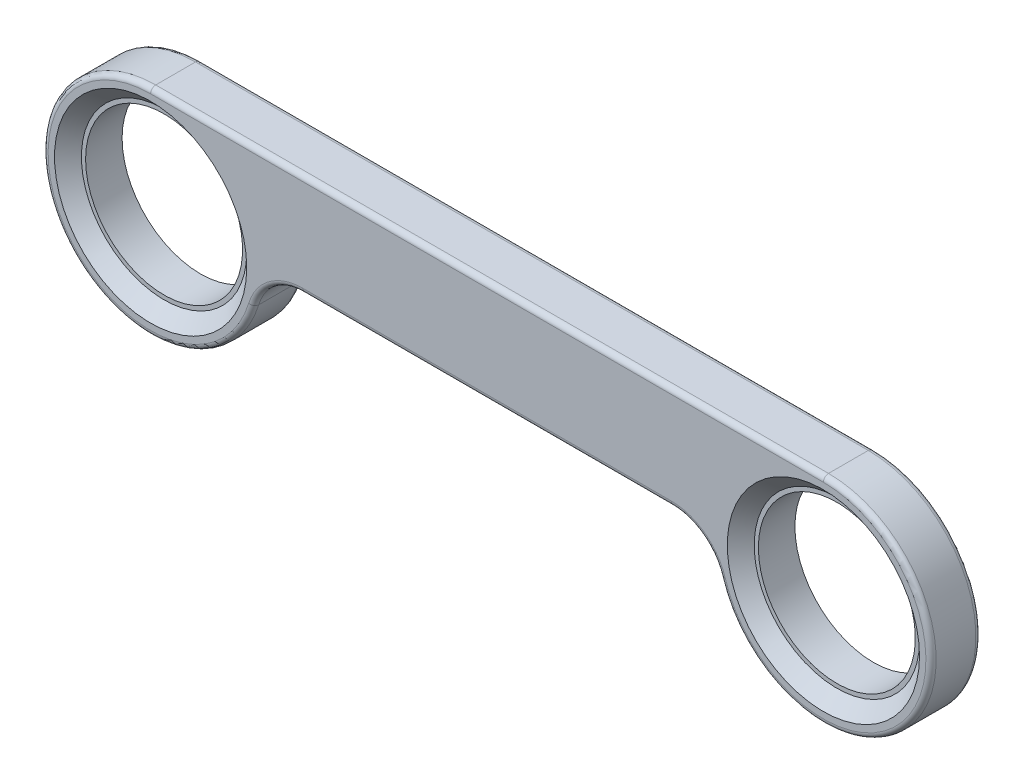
ISO-10303-21;
HEADER;
FILE_DESCRIPTION(('STEP AP214'),'2;1');
FILE_NAME('part.step','',(''),(''),'','','');
FILE_SCHEMA(('AUTOMOTIVE_DESIGN { 1 0 10303 214 1 1 1 1 }'));
ENDSEC;
DATA;
#1=APPLICATION_CONTEXT('core data for automotive mechanical design processes');
#2=APPLICATION_PROTOCOL_DEFINITION('international standard','automotive_design',2000,#1);
#3=PRODUCT_CONTEXT('',#1,'mechanical');
#4=PRODUCT('Part','Part','',(#3));
#5=PRODUCT_RELATED_PRODUCT_CATEGORY('part','',(#4));
#6=PRODUCT_DEFINITION_FORMATION('','',#4);
#7=PRODUCT_DEFINITION_CONTEXT('part definition',#1,'design');
#8=PRODUCT_DEFINITION('design','',#6,#7);
#9=PRODUCT_DEFINITION_SHAPE('','',#8);
#10=(LENGTH_UNIT() NAMED_UNIT(*) SI_UNIT(.MILLI.,.METRE.));
#11=(NAMED_UNIT(*) PLANE_ANGLE_UNIT() SI_UNIT($,.RADIAN.));
#12=(NAMED_UNIT(*) SI_UNIT($,.STERADIAN.) SOLID_ANGLE_UNIT());
#13=UNCERTAINTY_MEASURE_WITH_UNIT(LENGTH_MEASURE(1.E-05),#10,'distance_accuracy_value','');
#14=(GEOMETRIC_REPRESENTATION_CONTEXT(3) GLOBAL_UNCERTAINTY_ASSIGNED_CONTEXT((#13)) GLOBAL_UNIT_ASSIGNED_CONTEXT((#10,
#11,#12)) REPRESENTATION_CONTEXT('',''));
#15=CARTESIAN_POINT('',(0.,0.,0.));
#16=DIRECTION('',(0.,0.,1.));
#17=DIRECTION('',(1.,0.,0.));
#18=AXIS2_PLACEMENT_3D('',#15,#16,#17);
#19=CARTESIAN_POINT('',(-15.7912846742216,-4.572,2.47649999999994));
#20=DIRECTION('',(0.,0.,-1.));
#21=DIRECTION('',(-1.,0.,0.));
#22=AXIS2_PLACEMENT_3D('',#19,#20,#21);
#23=PLANE('',#22);
#24=CARTESIAN_POINT('',(-30.861,0.,2.47649999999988));
#25=DIRECTION('',(0.,0.,-1.));
#26=DIRECTION('',(-1.,0.,0.));
#27=AXIS2_PLACEMENT_3D('',#24,#25,#26);
#28=CIRCLE('',#27,10.16);
#29=CARTESIAN_POINT('',(-30.861,10.16,2.47649999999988));
#30=VERTEX_POINT('',#29);
#31=CARTESIAN_POINT('',(-21.1386030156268,-2.94967741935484,2.47649999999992));
#32=VERTEX_POINT('',#31);
#33=EDGE_CURVE('E57',#30,#32,#28,.F.);
#34=ORIENTED_EDGE('',*,*,#33,.T.);
#35=CARTESIAN_POINT('',(-15.7912846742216,-4.572,2.47649999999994));
#36=DIRECTION('',(0.,0.,-1.));
#37=DIRECTION('',(-1.,0.,0.));
#38=AXIS2_PLACEMENT_3D('',#35,#36,#37);
#39=CIRCLE('',#38,5.588);
#40=CARTESIAN_POINT('',(-15.7912846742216,1.01600000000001,2.47649999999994));
#41=VERTEX_POINT('',#40);
#42=EDGE_CURVE('E141',#32,#41,#39,.T.);
#43=ORIENTED_EDGE('',*,*,#42,.T.);
#44=DIRECTION('',(1.,0.,0.));
#45=VECTOR('',#44,1.);
#46=CARTESIAN_POINT('',(-15.7912846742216,1.01600000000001,2.47649999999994));
#47=LINE('',#46,#45);
#48=CARTESIAN_POINT('',(20.7442846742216,1.01600000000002,2.47650000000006));
#49=VERTEX_POINT('',#48);
#50=EDGE_CURVE('E167',#41,#49,#47,.T.);
#51=ORIENTED_EDGE('',*,*,#50,.T.);
#52=CARTESIAN_POINT('',(20.7442846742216,-4.57199999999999,2.47650000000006));
#53=DIRECTION('',(0.,0.,-1.));
#54=DIRECTION('',(-1.,0.,0.));
#55=AXIS2_PLACEMENT_3D('',#52,#53,#54);
#56=CIRCLE('',#55,5.588);
#57=CARTESIAN_POINT('',(26.0916030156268,-2.94967741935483,2.47650000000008));
#58=VERTEX_POINT('',#57);
#59=EDGE_CURVE('E299',#49,#58,#56,.T.);
#60=ORIENTED_EDGE('',*,*,#59,.T.);
#61=CARTESIAN_POINT('',(35.814,0.,2.47650000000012));
#62=DIRECTION('',(0.,0.,-1.));
#63=DIRECTION('',(-1.,0.,0.));
#64=AXIS2_PLACEMENT_3D('',#61,#62,#63);
#65=CIRCLE('',#64,10.16);
#66=CARTESIAN_POINT('',(35.814,10.16,2.47650000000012));
#67=VERTEX_POINT('',#66);
#68=EDGE_CURVE('E302',#58,#67,#65,.F.);
#69=ORIENTED_EDGE('',*,*,#68,.T.);
#70=DIRECTION('',(-1.,0.,0.));
#71=VECTOR('',#70,1.);
#72=CARTESIAN_POINT('',(-15.7912846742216,10.16,2.47649999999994));
#73=LINE('',#72,#71);
#74=EDGE_CURVE('E62',#67,#30,#73,.T.);
#75=ORIENTED_EDGE('',*,*,#74,.T.);
#76=EDGE_LOOP('',(#34,#43,#51,#60,#69,#75));
#77=FACE_BOUND('',#76,.T.);
#78=CARTESIAN_POINT('',(35.814,0.,2.47650000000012));
#79=DIRECTION('',(0.,0.,-1.));
#80=DIRECTION('',(-1.,0.,0.));
#81=AXIS2_PLACEMENT_3D('',#78,#79,#80);
#82=CIRCLE('',#81,9.525);
#83=CARTESIAN_POINT('',(45.339,0.,2.47650000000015));
#84=VERTEX_POINT('',#83);
#85=EDGE_CURVE('E241',#84,#84,#82,.T.);
#86=ORIENTED_EDGE('',*,*,#85,.T.);
#87=EDGE_LOOP('',(#86));
#88=FACE_BOUND('',#87,.T.);
#89=CARTESIAN_POINT('',(-30.861,0.,2.47649999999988));
#90=DIRECTION('',(0.,0.,-1.));
#91=DIRECTION('',(-1.,0.,0.));
#92=AXIS2_PLACEMENT_3D('',#89,#90,#91);
#93=CIRCLE('',#92,9.525);
#94=CARTESIAN_POINT('',(-21.336,0.,2.47649999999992));
#95=VERTEX_POINT('',#94);
#96=EDGE_CURVE('E234',#95,#95,#93,.T.);
#97=ORIENTED_EDGE('',*,*,#96,.T.);
#98=EDGE_LOOP('',(#97));
#99=FACE_BOUND('',#98,.T.);
#100=ADVANCED_FACE('F39',(#77,#88,#99),#23,.F.);
#101=CARTESIAN_POINT('',(-15.7912846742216,-4.572,-2.47650000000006));
#102=DIRECTION('',(0.,0.,-1.));
#103=DIRECTION('',(-1.,0.,0.));
#104=AXIS2_PLACEMENT_3D('',#101,#102,#103);
#105=PLANE('',#104);
#106=DIRECTION('',(1.,0.,0.));
#107=VECTOR('',#106,1.);
#108=CARTESIAN_POINT('',(-15.7912846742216,1.01600000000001,-2.47650000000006));
#109=LINE('',#108,#107);
#110=CARTESIAN_POINT('',(20.7442846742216,1.01600000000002,-2.47649999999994));
#111=VERTEX_POINT('',#110);
#112=CARTESIAN_POINT('',(-15.7912846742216,1.01600000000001,-2.47650000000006));
#113=VERTEX_POINT('',#112);
#114=EDGE_CURVE('E254',#111,#113,#109,.F.);
#115=ORIENTED_EDGE('',*,*,#114,.T.);
#116=CARTESIAN_POINT('',(-15.7912846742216,-4.572,-2.47650000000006));
#117=DIRECTION('',(0.,0.,-1.));
#118=DIRECTION('',(-1.,0.,0.));
#119=AXIS2_PLACEMENT_3D('',#116,#117,#118);
#120=CIRCLE('',#119,5.588);
#121=CARTESIAN_POINT('',(-21.1386030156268,-2.94967741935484,-2.47650000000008));
#122=VERTEX_POINT('',#121);
#123=EDGE_CURVE('E269',#113,#122,#120,.F.);
#124=ORIENTED_EDGE('',*,*,#123,.T.);
#125=CARTESIAN_POINT('',(-30.861,0.,-2.47650000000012));
#126=DIRECTION('',(0.,0.,-1.));
#127=DIRECTION('',(-1.,0.,0.));
#128=AXIS2_PLACEMENT_3D('',#125,#126,#127);
#129=CIRCLE('',#128,10.16);
#130=CARTESIAN_POINT('',(-30.861,10.16,-2.47650000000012));
#131=VERTEX_POINT('',#130);
#132=EDGE_CURVE('E266',#122,#131,#129,.T.);
#133=ORIENTED_EDGE('',*,*,#132,.T.);
#134=DIRECTION('',(-1.,0.,0.));
#135=VECTOR('',#134,1.);
#136=CARTESIAN_POINT('',(35.814,10.16,-2.47649999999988));
#137=LINE('',#136,#135);
#138=CARTESIAN_POINT('',(35.814,10.16,-2.47649999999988));
#139=VERTEX_POINT('',#138);
#140=EDGE_CURVE('E263',#131,#139,#137,.F.);
#141=ORIENTED_EDGE('',*,*,#140,.T.);
#142=CARTESIAN_POINT('',(35.814,0.,-2.47649999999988));
#143=DIRECTION('',(0.,0.,-1.));
#144=DIRECTION('',(-1.,0.,0.));
#145=AXIS2_PLACEMENT_3D('',#142,#143,#144);
#146=CIRCLE('',#145,10.16);
#147=CARTESIAN_POINT('',(26.0916030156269,-2.94967741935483,-2.47649999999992));
#148=VERTEX_POINT('',#147);
#149=EDGE_CURVE('E260',#139,#148,#146,.T.);
#150=ORIENTED_EDGE('',*,*,#149,.T.);
#151=CARTESIAN_POINT('',(20.7442846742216,-4.57199999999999,-2.47649999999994));
#152=DIRECTION('',(0.,0.,-1.));
#153=DIRECTION('',(-1.,0.,0.));
#154=AXIS2_PLACEMENT_3D('',#151,#152,#153);
#155=CIRCLE('',#154,5.588);
#156=EDGE_CURVE('E257',#148,#111,#155,.F.);
#157=ORIENTED_EDGE('',*,*,#156,.T.);
#158=EDGE_LOOP('',(#115,#124,#133,#141,#150,#157));
#159=FACE_BOUND('',#158,.T.);
#160=CARTESIAN_POINT('',(-30.861,0.,-2.47650000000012));
#161=DIRECTION('',(0.,0.,1.));
#162=DIRECTION('',(1.,0.,0.));
#163=AXIS2_PLACEMENT_3D('',#160,#161,#162);
#164=CIRCLE('',#163,7.77875);
#165=CARTESIAN_POINT('',(-23.08225,0.,-2.47650000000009));
#166=VERTEX_POINT('',#165);
#167=EDGE_CURVE('E344',#166,#166,#164,.T.);
#168=ORIENTED_EDGE('',*,*,#167,.T.);
#169=EDGE_LOOP('',(#168));
#170=FACE_BOUND('',#169,.T.);
#171=CARTESIAN_POINT('',(35.814,0.,-2.47649999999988));
#172=DIRECTION('',(0.,0.,1.));
#173=DIRECTION('',(1.,0.,0.));
#174=AXIS2_PLACEMENT_3D('',#171,#172,#173);
#175=CIRCLE('',#174,7.77875000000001);
#176=CARTESIAN_POINT('',(43.59275,0.,-2.47649999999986));
#177=VERTEX_POINT('',#176);
#178=EDGE_CURVE('E245',#177,#177,#175,.T.);
#179=ORIENTED_EDGE('',*,*,#178,.T.);
#180=EDGE_LOOP('',(#179));
#181=FACE_BOUND('',#180,.T.);
#182=ADVANCED_FACE('F355',(#159,#170,#181),#105,.T.);
#183=CARTESIAN_POINT('',(-15.7912846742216,-4.572,2.47649999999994));
#184=DIRECTION('',(0.,0.,-1.));
#185=DIRECTION('',(-1.,0.,0.));
#186=AXIS2_PLACEMENT_3D('',#183,#184,#185);
#187=CYLINDRICAL_SURFACE('',#186,5.08);
#188=DIRECTION('',(0.,0.,-1.));
#189=VECTOR('',#188,1.);
#190=CARTESIAN_POINT('',(-20.6524831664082,-3.09716129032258,2.47649999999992));
#191=LINE('',#190,#189);
#192=CARTESIAN_POINT('',(-20.6524831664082,-3.09716129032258,1.96849999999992));
#193=VERTEX_POINT('',#192);
#194=CARTESIAN_POINT('',(-20.6524831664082,-3.09716129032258,-1.96850000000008));
#195=VERTEX_POINT('',#194);
#196=EDGE_CURVE('E334',#193,#195,#191,.T.);
#197=ORIENTED_EDGE('',*,*,#196,.T.);
#198=CARTESIAN_POINT('',(-15.7912846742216,-4.572,-1.96850000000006));
#199=DIRECTION('',(0.,0.,-1.));
#200=DIRECTION('',(-1.,0.,0.));
#201=AXIS2_PLACEMENT_3D('',#198,#199,#200);
#202=CIRCLE('',#201,5.08);
#203=CARTESIAN_POINT('',(-15.7912846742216,0.50800000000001,-1.96850000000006));
#204=VERTEX_POINT('',#203);
#205=EDGE_CURVE('E152',#195,#204,#202,.T.);
#206=ORIENTED_EDGE('',*,*,#205,.T.);
#207=DIRECTION('',(0.,0.,-1.));
#208=VECTOR('',#207,1.);
#209=CARTESIAN_POINT('',(-15.7912846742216,0.50800000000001,2.47649999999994));
#210=LINE('',#209,#208);
#211=CARTESIAN_POINT('',(-15.7912846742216,0.50800000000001,1.96849999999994));
#212=VERTEX_POINT('',#211);
#213=EDGE_CURVE('E133',#212,#204,#210,.T.);
#214=ORIENTED_EDGE('',*,*,#213,.F.);
#215=CARTESIAN_POINT('',(-15.7912846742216,-4.572,1.96849999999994));
#216=DIRECTION('',(0.,0.,-1.));
#217=DIRECTION('',(-1.,0.,0.));
#218=AXIS2_PLACEMENT_3D('',#215,#216,#217);
#219=CIRCLE('',#218,5.08);
#220=EDGE_CURVE('E149',#212,#193,#219,.F.);
#221=ORIENTED_EDGE('',*,*,#220,.T.);
#222=EDGE_LOOP('',(#197,#206,#214,#221));
#223=FACE_BOUND('',#222,.T.);
#224=ADVANCED_FACE('F148',(#223),#187,.F.);
#225=CARTESIAN_POINT('',(-15.7912846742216,0.50800000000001,2.47649999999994));
#226=DIRECTION('',(0.,1.,0.));
#227=DIRECTION('',(-1.,0.,0.));
#228=AXIS2_PLACEMENT_3D('',#225,#226,#227);
#229=PLANE('',#228);
#230=ORIENTED_EDGE('',*,*,#213,.T.);
#231=DIRECTION('',(1.,0.,0.));
#232=VECTOR('',#231,1.);
#233=CARTESIAN_POINT('',(20.7442846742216,0.508000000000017,-1.96849999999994));
#234=LINE('',#233,#232);
#235=CARTESIAN_POINT('',(20.7442846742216,0.508000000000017,-1.96849999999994));
#236=VERTEX_POINT('',#235);
#237=EDGE_CURVE('E11',#204,#236,#234,.T.);
#238=ORIENTED_EDGE('',*,*,#237,.T.);
#239=DIRECTION('',(0.,0.,-1.));
#240=VECTOR('',#239,1.);
#241=CARTESIAN_POINT('',(20.7442846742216,0.508000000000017,2.47650000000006));
#242=LINE('',#241,#240);
#243=CARTESIAN_POINT('',(20.7442846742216,0.508000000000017,1.96850000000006));
#244=VERTEX_POINT('',#243);
#245=EDGE_CURVE('E135',#244,#236,#242,.T.);
#246=ORIENTED_EDGE('',*,*,#245,.F.);
#247=DIRECTION('',(1.,0.,0.));
#248=VECTOR('',#247,1.);
#249=CARTESIAN_POINT('',(-15.7912846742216,0.50800000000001,1.96849999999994));
#250=LINE('',#249,#248);
#251=EDGE_CURVE('E49',#244,#212,#250,.F.);
#252=ORIENTED_EDGE('',*,*,#251,.T.);
#253=EDGE_LOOP('',(#230,#238,#246,#252));
#254=FACE_BOUND('',#253,.T.);
#255=ADVANCED_FACE('F132',(#254),#229,.F.);
#256=CARTESIAN_POINT('',(20.7442846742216,-4.57199999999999,2.47650000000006));
#257=DIRECTION('',(0.,0.,-1.));
#258=DIRECTION('',(-1.,0.,0.));
#259=AXIS2_PLACEMENT_3D('',#256,#257,#258);
#260=CYLINDRICAL_SURFACE('',#259,5.08);
#261=ORIENTED_EDGE('',*,*,#245,.T.);
#262=CARTESIAN_POINT('',(20.7442846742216,-4.57199999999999,-1.96849999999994));
#263=DIRECTION('',(0.,0.,-1.));
#264=DIRECTION('',(-1.,0.,0.));
#265=AXIS2_PLACEMENT_3D('',#262,#263,#264);
#266=CIRCLE('',#265,5.08);
#267=CARTESIAN_POINT('',(25.6054831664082,-3.09716129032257,-1.96849999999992));
#268=VERTEX_POINT('',#267);
#269=EDGE_CURVE('E294',#236,#268,#266,.T.);
#270=ORIENTED_EDGE('',*,*,#269,.T.);
#271=DIRECTION('',(0.,0.,-1.));
#272=VECTOR('',#271,1.);
#273=CARTESIAN_POINT('',(25.6054831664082,-3.09716129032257,2.47650000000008));
#274=LINE('',#273,#272);
#275=CARTESIAN_POINT('',(25.6054831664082,-3.09716129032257,1.96850000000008));
#276=VERTEX_POINT('',#275);
#277=EDGE_CURVE('E317',#276,#268,#274,.T.);
#278=ORIENTED_EDGE('',*,*,#277,.F.);
#279=CARTESIAN_POINT('',(20.7442846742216,-4.57199999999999,1.96850000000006));
#280=DIRECTION('',(0.,0.,-1.));
#281=DIRECTION('',(-1.,0.,0.));
#282=AXIS2_PLACEMENT_3D('',#279,#280,#281);
#283=CIRCLE('',#282,5.08);
#284=EDGE_CURVE('E291',#276,#244,#283,.F.);
#285=ORIENTED_EDGE('',*,*,#284,.T.);
#286=EDGE_LOOP('',(#261,#270,#278,#285));
#287=FACE_BOUND('',#286,.T.);
#288=ADVANCED_FACE('F315',(#287),#260,.F.);
#289=CARTESIAN_POINT('',(35.814,0.,2.47650000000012));
#290=DIRECTION('',(0.,0.,-1.));
#291=DIRECTION('',(-1.,0.,0.));
#292=AXIS2_PLACEMENT_3D('',#289,#290,#291);
#293=CYLINDRICAL_SURFACE('',#292,10.668);
#294=ORIENTED_EDGE('',*,*,#277,.T.);
#295=CARTESIAN_POINT('',(35.814,0.,-1.96849999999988));
#296=DIRECTION('',(0.,0.,-1.));
#297=DIRECTION('',(-1.,0.,0.));
#298=AXIS2_PLACEMENT_3D('',#295,#296,#297);
#299=CIRCLE('',#298,10.668);
#300=CARTESIAN_POINT('',(35.814,10.668,-1.96849999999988));
#301=VERTEX_POINT('',#300);
#302=EDGE_CURVE('E288',#268,#301,#299,.F.);
#303=ORIENTED_EDGE('',*,*,#302,.T.);
#304=DIRECTION('',(0.,0.,-1.));
#305=VECTOR('',#304,1.);
#306=CARTESIAN_POINT('',(35.814,10.668,2.47650000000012));
#307=LINE('',#306,#305);
#308=CARTESIAN_POINT('',(35.814,10.668,1.96850000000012));
#309=VERTEX_POINT('',#308);
#310=EDGE_CURVE('E321',#309,#301,#307,.T.);
#311=ORIENTED_EDGE('',*,*,#310,.F.);
#312=CARTESIAN_POINT('',(35.814,0.,1.96850000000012));
#313=DIRECTION('',(0.,0.,-1.));
#314=DIRECTION('',(-1.,0.,0.));
#315=AXIS2_PLACEMENT_3D('',#312,#313,#314);
#316=CIRCLE('',#315,10.668);
#317=EDGE_CURVE('E285',#309,#276,#316,.T.);
#318=ORIENTED_EDGE('',*,*,#317,.T.);
#319=EDGE_LOOP('',(#294,#303,#311,#318));
#320=FACE_BOUND('',#319,.T.);
#321=ADVANCED_FACE('F385',(#320),#293,.T.);
#322=CARTESIAN_POINT('',(-30.861,10.668,2.47649999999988));
#323=DIRECTION('',(0.,-1.,0.));
#324=DIRECTION('',(1.,0.,0.));
#325=AXIS2_PLACEMENT_3D('',#322,#323,#324);
#326=PLANE('',#325);
#327=ORIENTED_EDGE('',*,*,#310,.T.);
#328=DIRECTION('',(-1.,0.,0.));
#329=VECTOR('',#328,1.);
#330=CARTESIAN_POINT('',(-30.861,10.668,-1.96850000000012));
#331=LINE('',#330,#329);
#332=CARTESIAN_POINT('',(-30.861,10.668,-1.96850000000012));
#333=VERTEX_POINT('',#332);
#334=EDGE_CURVE('E282',#301,#333,#331,.T.);
#335=ORIENTED_EDGE('',*,*,#334,.T.);
#336=DIRECTION('',(0.,0.,-1.));
#337=VECTOR('',#336,1.);
#338=CARTESIAN_POINT('',(-30.861,10.668,2.47649999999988));
#339=LINE('',#338,#337);
#340=CARTESIAN_POINT('',(-30.861,10.668,1.96849999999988));
#341=VERTEX_POINT('',#340);
#342=EDGE_CURVE('E332',#341,#333,#339,.T.);
#343=ORIENTED_EDGE('',*,*,#342,.F.);
#344=DIRECTION('',(-1.,0.,0.));
#345=VECTOR('',#344,1.);
#346=CARTESIAN_POINT('',(-30.861,10.668,1.96849999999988));
#347=LINE('',#346,#345);
#348=EDGE_CURVE('E279',#341,#309,#347,.F.);
#349=ORIENTED_EDGE('',*,*,#348,.T.);
#350=EDGE_LOOP('',(#327,#335,#343,#349));
#351=FACE_BOUND('',#350,.T.);
#352=ADVANCED_FACE('F337',(#351),#326,.F.);
#353=CARTESIAN_POINT('',(-30.861,0.,2.47649999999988));
#354=DIRECTION('',(0.,0.,-1.));
#355=DIRECTION('',(-1.,0.,0.));
#356=AXIS2_PLACEMENT_3D('',#353,#354,#355);
#357=CYLINDRICAL_SURFACE('',#356,10.668);
#358=ORIENTED_EDGE('',*,*,#342,.T.);
#359=CARTESIAN_POINT('',(-30.861,0.,-1.96850000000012));
#360=DIRECTION('',(0.,0.,-1.));
#361=DIRECTION('',(-1.,0.,0.));
#362=AXIS2_PLACEMENT_3D('',#359,#360,#361);
#363=CIRCLE('',#362,10.668);
#364=EDGE_CURVE('E276',#333,#195,#363,.F.);
#365=ORIENTED_EDGE('',*,*,#364,.T.);
#366=ORIENTED_EDGE('',*,*,#196,.F.);
#367=CARTESIAN_POINT('',(-30.861,0.,1.96849999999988));
#368=DIRECTION('',(0.,0.,-1.));
#369=DIRECTION('',(-1.,0.,0.));
#370=AXIS2_PLACEMENT_3D('',#367,#368,#369);
#371=CIRCLE('',#370,10.668);
#372=EDGE_CURVE('E273',#193,#341,#371,.T.);
#373=ORIENTED_EDGE('',*,*,#372,.T.);
#374=EDGE_LOOP('',(#358,#365,#366,#373));
#375=FACE_BOUND('',#374,.T.);
#376=ADVANCED_FACE('F331',(#375),#357,.T.);
#377=CARTESIAN_POINT('',(-30.861,0.,2.47649999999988));
#378=DIRECTION('',(0.,0.,-1.));
#379=DIRECTION('',(-1.,0.,0.));
#380=AXIS2_PLACEMENT_3D('',#377,#378,#379);
#381=CYLINDRICAL_SURFACE('',#380,7.77875);
#382=CARTESIAN_POINT('',(-30.861,0.,1.14299999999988));
#383=DIRECTION('',(0.,0.,-1.));
#384=DIRECTION('',(-1.,0.,0.));
#385=AXIS2_PLACEMENT_3D('',#382,#383,#384);
#386=CIRCLE('',#385,7.77875);
#387=CARTESIAN_POINT('',(-38.63975,0.,1.14299999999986));
#388=VERTEX_POINT('',#387);
#389=EDGE_CURVE('E228',#388,#388,#386,.T.);
#390=ORIENTED_EDGE('',*,*,#389,.F.);
#391=EDGE_LOOP('',(#390));
#392=FACE_BOUND('',#391,.T.);
#393=ORIENTED_EDGE('',*,*,#167,.F.);
#394=EDGE_LOOP('',(#393));
#395=FACE_BOUND('',#394,.T.);
#396=ADVANCED_FACE('F360',(#392,#395),#381,.F.);
#397=CARTESIAN_POINT('',(35.814,0.,2.47650000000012));
#398=DIRECTION('',(0.,0.,-1.));
#399=DIRECTION('',(-1.,0.,0.));
#400=AXIS2_PLACEMENT_3D('',#397,#398,#399);
#401=CYLINDRICAL_SURFACE('',#400,7.77875000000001);
#402=CARTESIAN_POINT('',(35.814,0.,1.14300000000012));
#403=DIRECTION('',(0.,0.,-1.));
#404=DIRECTION('',(-1.,0.,0.));
#405=AXIS2_PLACEMENT_3D('',#402,#403,#404);
#406=CIRCLE('',#405,7.77875000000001);
#407=CARTESIAN_POINT('',(28.03525,0.,1.14300000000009));
#408=VERTEX_POINT('',#407);
#409=EDGE_CURVE('E221',#408,#408,#406,.T.);
#410=ORIENTED_EDGE('',*,*,#409,.F.);
#411=EDGE_LOOP('',(#410));
#412=FACE_BOUND('',#411,.T.);
#413=ORIENTED_EDGE('',*,*,#178,.F.);
#414=EDGE_LOOP('',(#413));
#415=FACE_BOUND('',#414,.T.);
#416=ADVANCED_FACE('F357',(#412,#415),#401,.F.);
#417=CARTESIAN_POINT('',(35.814,0.,1.14300000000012));
#418=DIRECTION('',(0.,0.,-1.));
#419=DIRECTION('',(-1.,0.,0.));
#420=AXIS2_PLACEMENT_3D('',#417,#418,#419);
#421=PLANE('',#420);
#422=CARTESIAN_POINT('',(35.814,0.,1.14300000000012));
#423=DIRECTION('',(0.,0.,-1.));
#424=DIRECTION('',(-1.,0.,0.));
#425=AXIS2_PLACEMENT_3D('',#422,#423,#424);
#426=CIRCLE('',#425,8.19150000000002);
#427=CARTESIAN_POINT('',(44.0055,0.,1.14300000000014));
#428=VERTEX_POINT('',#427);
#429=EDGE_CURVE('E154',#428,#428,#426,.F.);
#430=ORIENTED_EDGE('',*,*,#429,.T.);
#431=EDGE_LOOP('',(#430));
#432=FACE_BOUND('',#431,.T.);
#433=ORIENTED_EDGE('',*,*,#409,.T.);
#434=EDGE_LOOP('',(#433));
#435=FACE_BOUND('',#434,.T.);
#436=ADVANCED_FACE('F359',(#432,#435),#421,.F.);
#437=CARTESIAN_POINT('',(-30.861,0.,1.14299999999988));
#438=DIRECTION('',(0.,0.,-1.));
#439=DIRECTION('',(-1.,0.,0.));
#440=AXIS2_PLACEMENT_3D('',#437,#438,#439);
#441=PLANE('',#440);
#442=CARTESIAN_POINT('',(-30.861,0.,1.14299999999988));
#443=DIRECTION('',(0.,0.,-1.));
#444=DIRECTION('',(-1.,0.,0.));
#445=AXIS2_PLACEMENT_3D('',#442,#443,#444);
#446=CIRCLE('',#445,8.19150000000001);
#447=CARTESIAN_POINT('',(-22.6695,0.,1.14299999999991));
#448=VERTEX_POINT('',#447);
#449=EDGE_CURVE('E164',#448,#448,#446,.F.);
#450=ORIENTED_EDGE('',*,*,#449,.T.);
#451=EDGE_LOOP('',(#450));
#452=FACE_BOUND('',#451,.T.);
#453=ORIENTED_EDGE('',*,*,#389,.T.);
#454=EDGE_LOOP('',(#453));
#455=FACE_BOUND('',#454,.T.);
#456=ADVANCED_FACE('F367',(#452,#455),#441,.F.);
#457=CARTESIAN_POINT('',(35.814,0.,2.47650000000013));
#458=DIRECTION('',(0.,0.,1.));
#459=DIRECTION('',(1.,0.,0.));
#460=AXIS2_PLACEMENT_3D('',#457,#458,#459);
#461=CONICAL_SURFACE('',#460,9.525,0.785398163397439);
#462=CARTESIAN_POINT('',(44.0055,0.,1.14300000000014));
#463=CARTESIAN_POINT('',(44.019390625,0.,1.15689062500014));
#464=CARTESIAN_POINT('',(44.03328125,0.,1.17078125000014));
#465=CARTESIAN_POINT('',(44.0610625,0.,1.19856250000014));
#466=CARTESIAN_POINT('',(44.074953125,0.,1.21245312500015));
#467=CARTESIAN_POINT('',(44.102734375,0.,1.24023437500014));
#468=CARTESIAN_POINT('',(44.116625,0.,1.25412500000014));
#469=CARTESIAN_POINT('',(44.14440625,0.,1.28190625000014));
#470=CARTESIAN_POINT('',(44.158296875,0.,1.29579687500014));
#471=CARTESIAN_POINT('',(44.186078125,0.,1.32357812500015));
#472=CARTESIAN_POINT('',(44.19996875,0.,1.33746875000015));
#473=CARTESIAN_POINT('',(44.22775,0.,1.36525000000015));
#474=CARTESIAN_POINT('',(44.241640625,0.,1.37914062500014));
#475=CARTESIAN_POINT('',(44.269421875,0.,1.40692187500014));
#476=CARTESIAN_POINT('',(44.2833125,0.,1.42081250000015));
#477=CARTESIAN_POINT('',(44.31109375,0.,1.44859375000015));
#478=CARTESIAN_POINT('',(44.324984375,0.,1.46248437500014));
#479=CARTESIAN_POINT('',(44.352765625,0.,1.49026562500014));
#480=CARTESIAN_POINT('',(44.36665625,0.,1.50415625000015));
#481=CARTESIAN_POINT('',(44.3944375,0.,1.53193750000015));
#482=CARTESIAN_POINT('',(44.408328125,0.,1.54582812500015));
#483=CARTESIAN_POINT('',(44.436109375,0.,1.57360937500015));
#484=CARTESIAN_POINT('',(44.45,0.,1.58750000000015));
#485=CARTESIAN_POINT('',(44.47778125,0.,1.61528125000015));
#486=CARTESIAN_POINT('',(44.491671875,0.,1.62917187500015));
#487=CARTESIAN_POINT('',(44.519453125,0.,1.65695312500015));
#488=CARTESIAN_POINT('',(44.53334375,0.,1.67084375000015));
#489=CARTESIAN_POINT('',(44.561125,0.,1.69862500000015));
#490=CARTESIAN_POINT('',(44.575015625,0.,1.71251562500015));
#491=CARTESIAN_POINT('',(44.602796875,0.,1.74029687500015));
#492=CARTESIAN_POINT('',(44.6166875,0.,1.75418750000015));
#493=CARTESIAN_POINT('',(44.64446875,0.,1.78196875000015));
#494=CARTESIAN_POINT('',(44.658359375,0.,1.79585937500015));
#495=CARTESIAN_POINT('',(44.686140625,0.,1.82364062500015));
#496=CARTESIAN_POINT('',(44.70003125,0.,1.83753125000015));
#497=CARTESIAN_POINT('',(44.7278125,0.,1.86531250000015));
#498=CARTESIAN_POINT('',(44.741703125,0.,1.87920312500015));
#499=CARTESIAN_POINT('',(44.769484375,0.,1.90698437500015));
#500=CARTESIAN_POINT('',(44.783375,0.,1.92087500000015));
#501=CARTESIAN_POINT('',(44.81115625,0.,1.94865625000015));
#502=CARTESIAN_POINT('',(44.825046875,0.,1.96254687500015));
#503=CARTESIAN_POINT('',(44.852828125,0.,1.99032812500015));
#504=CARTESIAN_POINT('',(44.86671875,0.,2.00421875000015));
#505=CARTESIAN_POINT('',(44.8945,0.,2.03200000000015));
#506=CARTESIAN_POINT('',(44.908390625,0.,2.04589062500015));
#507=CARTESIAN_POINT('',(44.936171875,0.,2.07367187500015));
#508=CARTESIAN_POINT('',(44.9500625,0.,2.08756250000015));
#509=CARTESIAN_POINT('',(44.97784375,0.,2.11534375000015));
#510=CARTESIAN_POINT('',(44.991734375,0.,2.12923437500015));
#511=CARTESIAN_POINT('',(45.019515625,0.,2.15701562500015));
#512=CARTESIAN_POINT('',(45.03340625,0.,2.17090625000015));
#513=CARTESIAN_POINT('',(45.0611875,0.,2.19868750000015));
#514=CARTESIAN_POINT('',(45.075078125,0.,2.21257812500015));
#515=CARTESIAN_POINT('',(45.102859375,0.,2.24035937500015));
#516=CARTESIAN_POINT('',(45.11675,0.,2.25425000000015));
#517=CARTESIAN_POINT('',(45.14453125,0.,2.28203125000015));
#518=CARTESIAN_POINT('',(45.158421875,0.,2.29592187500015));
#519=CARTESIAN_POINT('',(45.186203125,0.,2.32370312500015));
#520=CARTESIAN_POINT('',(45.20009375,0.,2.33759375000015));
#521=CARTESIAN_POINT('',(45.227875,0.,2.36537500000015));
#522=CARTESIAN_POINT('',(45.241765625,0.,2.37926562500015));
#523=CARTESIAN_POINT('',(45.269546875,0.,2.40704687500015));
#524=CARTESIAN_POINT('',(45.2834375,0.,2.42093750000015));
#525=CARTESIAN_POINT('',(45.31121875,0.,2.44871875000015));
#526=CARTESIAN_POINT('',(45.325109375,0.,2.46260937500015));
#527=CARTESIAN_POINT('',(45.339,0.,2.47650000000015));
#528=B_SPLINE_CURVE_WITH_KNOTS('',3,(#462,#463,#464,#465,#466,#467,#468,#469,#470,#471,#472,
#473,#474,#475,#476,#477,#478,#479,#480,#481,#482,#483,#484,#485,#486,#487,#488,#489,#490,#491,
#492,#493,#494,#495,#496,#497,#498,#499,#500,#501,#502,#503,#504,#505,#506,#507,#508,#509,#510,
#511,#512,#513,#514,#515,#516,#517,#518,#519,#520,#521,#522,#523,#524,#525,#526,#527),
.UNSPECIFIED.,.F.,.F.,(4,2,2,2,2,2,2,2,2,2,2,2,2,2,2,2,2,2,2,2,2,2,2,2,2,2,2,2,2,2,2,2,4),(0.,
0.0589329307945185,0.117865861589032,0.176798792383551,0.235731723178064,0.294664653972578,
0.353597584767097,0.41253051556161,0.471463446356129,0.530396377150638,0.589329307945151,
0.64826223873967,0.707195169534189,0.766128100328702,0.825061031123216,0.883993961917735,
0.942926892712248,1.00185982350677,1.06079275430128,1.11972568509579,1.17865861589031,
1.23759154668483,1.29652447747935,1.35545740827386,1.41439033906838,1.47332326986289,
1.53225620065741,1.59118913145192,1.65012206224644,1.70905499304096,1.76798792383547,
1.82692085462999,1.8858537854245),.UNSPECIFIED.);
#529=EDGE_CURVE('BSEAM394',#428,#84,#528,.T.);
#530=ORIENTED_EDGE('',*,*,#429,.F.);
#531=ORIENTED_EDGE('',*,*,#85,.F.);
#532=ORIENTED_EDGE('',*,*,#529,.T.);
#533=ORIENTED_EDGE('',*,*,#529,.F.);
#534=EDGE_LOOP('',(#530,#532,#531,#533));
#535=FACE_BOUND('',#534,.T.);
#536=ADVANCED_FACE('F394',(#535),#461,.F.);
#537=CARTESIAN_POINT('',(-30.861,0.,2.4764999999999));
#538=DIRECTION('',(0.,0.,1.));
#539=DIRECTION('',(1.,0.,0.));
#540=AXIS2_PLACEMENT_3D('',#537,#538,#539);
#541=CONICAL_SURFACE('',#540,9.525,0.785398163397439);
#542=CARTESIAN_POINT('',(-22.6695,0.,1.14299999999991));
#543=CARTESIAN_POINT('',(-22.655609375,0.,1.15689062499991));
#544=CARTESIAN_POINT('',(-22.64171875,0.,1.17078124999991));
#545=CARTESIAN_POINT('',(-22.6139375,0.,1.19856249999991));
#546=CARTESIAN_POINT('',(-22.600046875,0.,1.21245312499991));
#547=CARTESIAN_POINT('',(-22.572265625,0.,1.24023437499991));
#548=CARTESIAN_POINT('',(-22.558375,0.,1.25412499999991));
#549=CARTESIAN_POINT('',(-22.53059375,0.,1.28190624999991));
#550=CARTESIAN_POINT('',(-22.516703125,0.,1.29579687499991));
#551=CARTESIAN_POINT('',(-22.488921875,0.,1.32357812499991));
#552=CARTESIAN_POINT('',(-22.47503125,0.,1.33746874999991));
#553=CARTESIAN_POINT('',(-22.44725,0.,1.36524999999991));
#554=CARTESIAN_POINT('',(-22.433359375,0.,1.37914062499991));
#555=CARTESIAN_POINT('',(-22.405578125,0.,1.40692187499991));
#556=CARTESIAN_POINT('',(-22.3916875,0.,1.42081249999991));
#557=CARTESIAN_POINT('',(-22.36390625,0.,1.44859374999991));
#558=CARTESIAN_POINT('',(-22.350015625,0.,1.46248437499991));
#559=CARTESIAN_POINT('',(-22.322234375,0.,1.49026562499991));
#560=CARTESIAN_POINT('',(-22.30834375,0.,1.50415624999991));
#561=CARTESIAN_POINT('',(-22.2805625,0.,1.53193749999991));
#562=CARTESIAN_POINT('',(-22.266671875,0.,1.54582812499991));
#563=CARTESIAN_POINT('',(-22.238890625,0.,1.57360937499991));
#564=CARTESIAN_POINT('',(-22.225,0.,1.58749999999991));
#565=CARTESIAN_POINT('',(-22.19721875,0.,1.61528124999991));
#566=CARTESIAN_POINT('',(-22.183328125,0.,1.62917187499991));
#567=CARTESIAN_POINT('',(-22.155546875,0.,1.65695312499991));
#568=CARTESIAN_POINT('',(-22.14165625,0.,1.67084374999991));
#569=CARTESIAN_POINT('',(-22.113875,0.,1.69862499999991));
#570=CARTESIAN_POINT('',(-22.099984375,0.,1.71251562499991));
#571=CARTESIAN_POINT('',(-22.072203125,0.,1.74029687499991));
#572=CARTESIAN_POINT('',(-22.0583125,0.,1.75418749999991));
#573=CARTESIAN_POINT('',(-22.03053125,0.,1.78196874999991));
#574=CARTESIAN_POINT('',(-22.016640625,0.,1.79585937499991));
#575=CARTESIAN_POINT('',(-21.988859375,0.,1.82364062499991));
#576=CARTESIAN_POINT('',(-21.97496875,0.,1.83753124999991));
#577=CARTESIAN_POINT('',(-21.9471875,0.,1.86531249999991));
#578=CARTESIAN_POINT('',(-21.933296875,0.,1.87920312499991));
#579=CARTESIAN_POINT('',(-21.905515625,0.,1.90698437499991));
#580=CARTESIAN_POINT('',(-21.891625,0.,1.92087499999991));
#581=CARTESIAN_POINT('',(-21.86384375,0.,1.94865624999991));
#582=CARTESIAN_POINT('',(-21.849953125,0.,1.96254687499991));
#583=CARTESIAN_POINT('',(-21.822171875,0.,1.99032812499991));
#584=CARTESIAN_POINT('',(-21.80828125,0.,2.00421874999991));
#585=CARTESIAN_POINT('',(-21.7805,0.,2.03199999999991));
#586=CARTESIAN_POINT('',(-21.766609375,0.,2.04589062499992));
#587=CARTESIAN_POINT('',(-21.738828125,0.,2.07367187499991));
#588=CARTESIAN_POINT('',(-21.7249375,0.,2.08756249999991));
#589=CARTESIAN_POINT('',(-21.69715625,0.,2.11534374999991));
#590=CARTESIAN_POINT('',(-21.683265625,0.,2.12923437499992));
#591=CARTESIAN_POINT('',(-21.655484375,0.,2.15701562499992));
#592=CARTESIAN_POINT('',(-21.64159375,0.,2.17090624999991));
#593=CARTESIAN_POINT('',(-21.6138125,0.,2.19868749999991));
#594=CARTESIAN_POINT('',(-21.599921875,0.,2.21257812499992));
#595=CARTESIAN_POINT('',(-21.572140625,0.,2.24035937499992));
#596=CARTESIAN_POINT('',(-21.55825,0.,2.25424999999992));
#597=CARTESIAN_POINT('',(-21.53046875,0.,2.28203124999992));
#598=CARTESIAN_POINT('',(-21.516578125,0.,2.29592187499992));
#599=CARTESIAN_POINT('',(-21.488796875,0.,2.32370312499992));
#600=CARTESIAN_POINT('',(-21.47490625,0.,2.33759374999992));
#601=CARTESIAN_POINT('',(-21.447125,0.,2.36537499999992));
#602=CARTESIAN_POINT('',(-21.433234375,0.,2.37926562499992));
#603=CARTESIAN_POINT('',(-21.405453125,0.,2.40704687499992));
#604=CARTESIAN_POINT('',(-21.3915625,0.,2.42093749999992));
#605=CARTESIAN_POINT('',(-21.36378125,0.,2.44871874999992));
#606=CARTESIAN_POINT('',(-21.349890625,0.,2.46260937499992));
#607=CARTESIAN_POINT('',(-21.336,0.,2.47649999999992));
#608=B_SPLINE_CURVE_WITH_KNOTS('',3,(#542,#543,#544,#545,#546,#547,#548,#549,#550,#551,#552,
#553,#554,#555,#556,#557,#558,#559,#560,#561,#562,#563,#564,#565,#566,#567,#568,#569,#570,#571,
#572,#573,#574,#575,#576,#577,#578,#579,#580,#581,#582,#583,#584,#585,#586,#587,#588,#589,#590,
#591,#592,#593,#594,#595,#596,#597,#598,#599,#600,#601,#602,#603,#604,#605,#606,#607),
.UNSPECIFIED.,.F.,.F.,(4,2,2,2,2,2,2,2,2,2,2,2,2,2,2,2,2,2,2,2,2,2,2,2,2,2,2,2,2,2,2,2,4),(0.,
0.0589329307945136,0.11786586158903,0.176798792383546,0.235731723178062,0.294664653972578,
0.353597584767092,0.41253051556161,0.471463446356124,0.530396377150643,0.589329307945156,
0.648262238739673,0.707195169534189,0.766128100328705,0.825061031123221,0.883993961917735,
0.942926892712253,1.00185982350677,1.06079275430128,1.1197256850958,1.17865861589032,
1.23759154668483,1.29652447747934,1.35545740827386,1.41439033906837,1.47332326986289,
1.53225620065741,1.59118913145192,1.65012206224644,1.70905499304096,1.76798792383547,
1.82692085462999,1.8858537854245),.UNSPECIFIED.);
#609=EDGE_CURVE('BSEAM397',#448,#95,#608,.T.);
#610=ORIENTED_EDGE('',*,*,#449,.F.);
#611=ORIENTED_EDGE('',*,*,#96,.F.);
#612=ORIENTED_EDGE('',*,*,#609,.T.);
#613=ORIENTED_EDGE('',*,*,#609,.F.);
#614=EDGE_LOOP('',(#610,#612,#611,#613));
#615=FACE_BOUND('',#614,.T.);
#616=ADVANCED_FACE('F397',(#615),#541,.F.);
#617=CARTESIAN_POINT('',(35.814,0.,-1.96849999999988));
#618=DIRECTION('',(0.,0.,-1.));
#619=DIRECTION('',(-1.,0.,0.));
#620=AXIS2_PLACEMENT_3D('',#617,#618,#619);
#621=TOROIDAL_SURFACE('',#620,10.16,0.508);
#622=CARTESIAN_POINT('',(26.0916030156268,-2.94967741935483,-1.96849999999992));
#623=DIRECTION('',(-0.290322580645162,0.956928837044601,0.));
#624=DIRECTION('',(-0.956928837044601,-0.290322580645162,0.));
#625=AXIS2_PLACEMENT_3D('',#622,#623,#624);
#626=CIRCLE('',#625,0.508);
#627=EDGE_CURVE('E212',#148,#268,#626,.T.);
#628=ORIENTED_EDGE('',*,*,#627,.F.);
#629=ORIENTED_EDGE('',*,*,#149,.F.);
#630=CARTESIAN_POINT('',(35.814,10.16,-1.96849999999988));
#631=DIRECTION('',(-1.,0.,0.));
#632=DIRECTION('',(0.,0.,1.));
#633=AXIS2_PLACEMENT_3D('',#630,#631,#632);
#634=CIRCLE('',#633,0.508);
#635=EDGE_CURVE('E174',#301,#139,#634,.T.);
#636=ORIENTED_EDGE('',*,*,#635,.F.);
#637=ORIENTED_EDGE('',*,*,#302,.F.);
#638=EDGE_LOOP('',(#628,#629,#636,#637));
#639=FACE_BOUND('',#638,.T.);
#640=ADVANCED_FACE('F401',(#639),#621,.T.);
#641=CARTESIAN_POINT('',(-30.861,10.16,-1.96850000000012));
#642=DIRECTION('',(1.,0.,0.));
#643=DIRECTION('',(0.,1.,0.));
#644=AXIS2_PLACEMENT_3D('',#641,#642,#643);
#645=CYLINDRICAL_SURFACE('',#644,0.508);
#646=ORIENTED_EDGE('',*,*,#635,.T.);
#647=ORIENTED_EDGE('',*,*,#140,.F.);
#648=CARTESIAN_POINT('',(-30.861,10.16,-1.96850000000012));
#649=DIRECTION('',(-1.,0.,0.));
#650=DIRECTION('',(0.,0.,1.));
#651=AXIS2_PLACEMENT_3D('',#648,#649,#650);
#652=CIRCLE('',#651,0.508);
#653=EDGE_CURVE('E209',#333,#131,#652,.T.);
#654=ORIENTED_EDGE('',*,*,#653,.F.);
#655=ORIENTED_EDGE('',*,*,#334,.F.);
#656=EDGE_LOOP('',(#646,#647,#654,#655));
#657=FACE_BOUND('',#656,.T.);
#658=ADVANCED_FACE('F417',(#657),#645,.T.);
#659=CARTESIAN_POINT('',(20.7442846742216,-4.57199999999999,-1.96849999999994));
#660=DIRECTION('',(0.,0.,-1.));
#661=DIRECTION('',(-1.,0.,0.));
#662=AXIS2_PLACEMENT_3D('',#659,#660,#661);
#663=TOROIDAL_SURFACE('',#662,5.588,0.508);
#664=ORIENTED_EDGE('',*,*,#627,.T.);
#665=ORIENTED_EDGE('',*,*,#269,.F.);
#666=CARTESIAN_POINT('',(20.7442846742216,1.01600000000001,-1.96849999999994));
#667=DIRECTION('',(-1.,0.,0.));
#668=DIRECTION('',(0.,0.,1.));
#669=AXIS2_PLACEMENT_3D('',#666,#667,#668);
#670=CIRCLE('',#669,0.508);
#671=EDGE_CURVE('E203',#111,#236,#670,.T.);
#672=ORIENTED_EDGE('',*,*,#671,.F.);
#673=ORIENTED_EDGE('',*,*,#156,.F.);
#674=EDGE_LOOP('',(#664,#665,#672,#673));
#675=FACE_BOUND('',#674,.T.);
#676=ADVANCED_FACE('F413',(#675),#663,.T.);
#677=CARTESIAN_POINT('',(-30.861,0.,-1.96850000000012));
#678=DIRECTION('',(0.,0.,-1.));
#679=DIRECTION('',(-1.,0.,0.));
#680=AXIS2_PLACEMENT_3D('',#677,#678,#679);
#681=TOROIDAL_SURFACE('',#680,10.16,0.508);
#682=ORIENTED_EDGE('',*,*,#653,.T.);
#683=ORIENTED_EDGE('',*,*,#132,.F.);
#684=CARTESIAN_POINT('',(-21.1386030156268,-2.94967741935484,-1.96850000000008));
#685=DIRECTION('',(0.290322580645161,0.956928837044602,0.));
#686=DIRECTION('',(-0.956928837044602,0.290322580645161,0.));
#687=AXIS2_PLACEMENT_3D('',#684,#685,#686);
#688=CIRCLE('',#687,0.508);
#689=EDGE_CURVE('E196',#195,#122,#688,.T.);
#690=ORIENTED_EDGE('',*,*,#689,.F.);
#691=ORIENTED_EDGE('',*,*,#364,.F.);
#692=EDGE_LOOP('',(#682,#683,#690,#691));
#693=FACE_BOUND('',#692,.T.);
#694=ADVANCED_FACE('F409',(#693),#681,.T.);
#695=CARTESIAN_POINT('',(-15.7912846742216,1.01600000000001,-1.96850000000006));
#696=DIRECTION('',(-1.,0.,0.));
#697=DIRECTION('',(0.,-1.,0.));
#698=AXIS2_PLACEMENT_3D('',#695,#696,#697);
#699=CYLINDRICAL_SURFACE('',#698,0.508);
#700=ORIENTED_EDGE('',*,*,#671,.T.);
#701=ORIENTED_EDGE('',*,*,#237,.F.);
#702=CARTESIAN_POINT('',(-15.7912846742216,1.01600000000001,-1.96850000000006));
#703=DIRECTION('',(-1.,0.,0.));
#704=DIRECTION('',(0.,0.,1.));
#705=AXIS2_PLACEMENT_3D('',#702,#703,#704);
#706=CIRCLE('',#705,0.508);
#707=EDGE_CURVE('E191',#113,#204,#706,.T.);
#708=ORIENTED_EDGE('',*,*,#707,.F.);
#709=ORIENTED_EDGE('',*,*,#114,.F.);
#710=EDGE_LOOP('',(#700,#701,#708,#709));
#711=FACE_BOUND('',#710,.T.);
#712=ADVANCED_FACE('F406',(#711),#699,.T.);
#713=CARTESIAN_POINT('',(-15.7912846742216,-4.572,-1.96850000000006));
#714=DIRECTION('',(0.,0.,-1.));
#715=DIRECTION('',(-1.,0.,0.));
#716=AXIS2_PLACEMENT_3D('',#713,#714,#715);
#717=TOROIDAL_SURFACE('',#716,5.588,0.508);
#718=ORIENTED_EDGE('',*,*,#689,.T.);
#719=ORIENTED_EDGE('',*,*,#123,.F.);
#720=ORIENTED_EDGE('',*,*,#707,.T.);
#721=ORIENTED_EDGE('',*,*,#205,.F.);
#722=EDGE_LOOP('',(#718,#719,#720,#721));
#723=FACE_BOUND('',#722,.T.);
#724=ADVANCED_FACE('F403',(#723),#717,.T.);
#725=CARTESIAN_POINT('',(35.814,0.,1.96850000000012));
#726=DIRECTION('',(0.,0.,-1.));
#727=DIRECTION('',(-1.,0.,0.));
#728=AXIS2_PLACEMENT_3D('',#725,#726,#727);
#729=TOROIDAL_SURFACE('',#728,10.16,0.508);
#730=CARTESIAN_POINT('',(26.0916030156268,-2.94967741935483,1.96850000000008));
#731=DIRECTION('',(-0.290322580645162,0.956928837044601,0.));
#732=DIRECTION('',(-0.956928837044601,-0.290322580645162,0.));
#733=AXIS2_PLACEMENT_3D('',#730,#731,#732);
#734=CIRCLE('',#733,0.508);
#735=EDGE_CURVE('E182',#276,#58,#734,.T.);
#736=ORIENTED_EDGE('',*,*,#735,.F.);
#737=ORIENTED_EDGE('',*,*,#317,.F.);
#738=CARTESIAN_POINT('',(35.814,10.16,1.96850000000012));
#739=DIRECTION('',(-1.,0.,0.));
#740=DIRECTION('',(0.,0.,1.));
#741=AXIS2_PLACEMENT_3D('',#738,#739,#740);
#742=CIRCLE('',#741,0.508);
#743=EDGE_CURVE('E43',#67,#309,#742,.T.);
#744=ORIENTED_EDGE('',*,*,#743,.F.);
#745=ORIENTED_EDGE('',*,*,#68,.F.);
#746=EDGE_LOOP('',(#736,#737,#744,#745));
#747=FACE_BOUND('',#746,.T.);
#748=ADVANCED_FACE('F41',(#747),#729,.T.);
#749=CARTESIAN_POINT('',(-15.7912846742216,10.16,1.96849999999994));
#750=DIRECTION('',(-1.,0.,0.));
#751=DIRECTION('',(0.,-1.,0.));
#752=AXIS2_PLACEMENT_3D('',#749,#750,#751);
#753=CYLINDRICAL_SURFACE('',#752,0.508);
#754=ORIENTED_EDGE('',*,*,#743,.T.);
#755=ORIENTED_EDGE('',*,*,#348,.F.);
#756=CARTESIAN_POINT('',(-30.861,10.16,1.96849999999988));
#757=DIRECTION('',(-1.,0.,0.));
#758=DIRECTION('',(0.,0.,1.));
#759=AXIS2_PLACEMENT_3D('',#756,#757,#758);
#760=CIRCLE('',#759,0.508);
#761=EDGE_CURVE('E179',#30,#341,#760,.T.);
#762=ORIENTED_EDGE('',*,*,#761,.F.);
#763=ORIENTED_EDGE('',*,*,#74,.F.);
#764=EDGE_LOOP('',(#754,#755,#762,#763));
#765=FACE_BOUND('',#764,.T.);
#766=ADVANCED_FACE('F325',(#765),#753,.T.);
#767=CARTESIAN_POINT('',(20.7442846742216,-4.57199999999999,1.96850000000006));
#768=DIRECTION('',(0.,0.,-1.));
#769=DIRECTION('',(-1.,0.,0.));
#770=AXIS2_PLACEMENT_3D('',#767,#768,#769);
#771=TOROIDAL_SURFACE('',#770,5.588,0.508);
#772=ORIENTED_EDGE('',*,*,#735,.T.);
#773=ORIENTED_EDGE('',*,*,#59,.F.);
#774=CARTESIAN_POINT('',(20.7442846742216,1.01600000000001,1.96850000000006));
#775=DIRECTION('',(-1.,0.,0.));
#776=DIRECTION('',(0.,0.,1.));
#777=AXIS2_PLACEMENT_3D('',#774,#775,#776);
#778=CIRCLE('',#777,0.508);
#779=EDGE_CURVE('E171',#244,#49,#778,.T.);
#780=ORIENTED_EDGE('',*,*,#779,.F.);
#781=ORIENTED_EDGE('',*,*,#284,.F.);
#782=EDGE_LOOP('',(#772,#773,#780,#781));
#783=FACE_BOUND('',#782,.T.);
#784=ADVANCED_FACE('F312',(#783),#771,.T.);
#785=CARTESIAN_POINT('',(-30.861,0.,1.96849999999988));
#786=DIRECTION('',(0.,0.,-1.));
#787=DIRECTION('',(-1.,0.,0.));
#788=AXIS2_PLACEMENT_3D('',#785,#786,#787);
#789=TOROIDAL_SURFACE('',#788,10.16,0.508);
#790=ORIENTED_EDGE('',*,*,#761,.T.);
#791=ORIENTED_EDGE('',*,*,#372,.F.);
#792=CARTESIAN_POINT('',(-21.1386030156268,-2.94967741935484,1.96849999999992));
#793=DIRECTION('',(0.290322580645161,0.956928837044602,0.));
#794=DIRECTION('',(-0.956928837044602,0.290322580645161,0.));
#795=AXIS2_PLACEMENT_3D('',#792,#793,#794);
#796=CIRCLE('',#795,0.508);
#797=EDGE_CURVE('E161',#32,#193,#796,.T.);
#798=ORIENTED_EDGE('',*,*,#797,.F.);
#799=ORIENTED_EDGE('',*,*,#33,.F.);
#800=EDGE_LOOP('',(#790,#791,#798,#799));
#801=FACE_BOUND('',#800,.T.);
#802=ADVANCED_FACE('F327',(#801),#789,.T.);
#803=CARTESIAN_POINT('',(-15.7912846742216,1.01600000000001,1.96849999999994));
#804=DIRECTION('',(1.,0.,0.));
#805=DIRECTION('',(0.,1.,0.));
#806=AXIS2_PLACEMENT_3D('',#803,#804,#805);
#807=CYLINDRICAL_SURFACE('',#806,0.508);
#808=ORIENTED_EDGE('',*,*,#779,.T.);
#809=ORIENTED_EDGE('',*,*,#50,.F.);
#810=CARTESIAN_POINT('',(-15.7912846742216,1.01600000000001,1.96849999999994));
#811=DIRECTION('',(-1.,0.,0.));
#812=DIRECTION('',(0.,0.,1.));
#813=AXIS2_PLACEMENT_3D('',#810,#811,#812);
#814=CIRCLE('',#813,0.508);
#815=EDGE_CURVE('E159',#212,#41,#814,.T.);
#816=ORIENTED_EDGE('',*,*,#815,.F.);
#817=ORIENTED_EDGE('',*,*,#251,.F.);
#818=EDGE_LOOP('',(#808,#809,#816,#817));
#819=FACE_BOUND('',#818,.T.);
#820=ADVANCED_FACE('F166',(#819),#807,.T.);
#821=CARTESIAN_POINT('',(-15.7912846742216,-4.572,1.96849999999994));
#822=DIRECTION('',(0.,0.,-1.));
#823=DIRECTION('',(-1.,0.,0.));
#824=AXIS2_PLACEMENT_3D('',#821,#822,#823);
#825=TOROIDAL_SURFACE('',#824,5.588,0.508);
#826=ORIENTED_EDGE('',*,*,#797,.T.);
#827=ORIENTED_EDGE('',*,*,#220,.F.);
#828=ORIENTED_EDGE('',*,*,#815,.T.);
#829=ORIENTED_EDGE('',*,*,#42,.F.);
#830=EDGE_LOOP('',(#826,#827,#828,#829));
#831=FACE_BOUND('',#830,.T.);
#832=ADVANCED_FACE('F157',(#831),#825,.T.);
#833=CLOSED_SHELL('',(#100,#182,#224,#255,#288,#321,#352,#376,#396,#416,#436,#456,#536,#616,
#640,#658,#676,#694,#712,#724,#748,#766,#784,#802,#820,#832));
#834=MANIFOLD_SOLID_BREP('B2',#833);
#835=ADVANCED_BREP_SHAPE_REPRESENTATION('',(#18,#834),#14);
#836=SHAPE_DEFINITION_REPRESENTATION(#9,#835);
ENDSEC;
END-ISO-10303-21;
